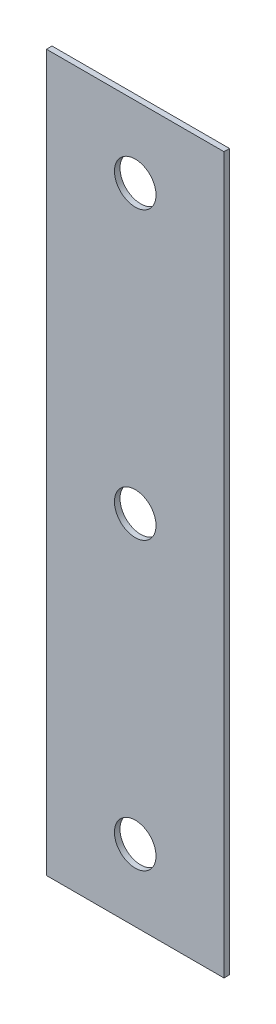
ISO-10303-21;
HEADER;
FILE_DESCRIPTION(('STEP AP214'),'2;1');
FILE_NAME('part.step','',(''),(''),'','','');
FILE_SCHEMA(('AUTOMOTIVE_DESIGN { 1 0 10303 214 1 1 1 1 }'));
ENDSEC;
DATA;
#1=APPLICATION_CONTEXT('core data for automotive mechanical design processes');
#2=APPLICATION_PROTOCOL_DEFINITION('international standard','automotive_design',2000,#1);
#3=PRODUCT_CONTEXT('',#1,'mechanical');
#4=PRODUCT('Part','Part','',(#3));
#5=PRODUCT_RELATED_PRODUCT_CATEGORY('part','',(#4));
#6=PRODUCT_DEFINITION_FORMATION('','',#4);
#7=PRODUCT_DEFINITION_CONTEXT('part definition',#1,'design');
#8=PRODUCT_DEFINITION('design','',#6,#7);
#9=PRODUCT_DEFINITION_SHAPE('','',#8);
#10=(LENGTH_UNIT() NAMED_UNIT(*) SI_UNIT(.MILLI.,.METRE.));
#11=(NAMED_UNIT(*) PLANE_ANGLE_UNIT() SI_UNIT($,.RADIAN.));
#12=(NAMED_UNIT(*) SI_UNIT($,.STERADIAN.) SOLID_ANGLE_UNIT());
#13=UNCERTAINTY_MEASURE_WITH_UNIT(LENGTH_MEASURE(1.E-05),#10,'distance_accuracy_value','');
#14=(GEOMETRIC_REPRESENTATION_CONTEXT(3) GLOBAL_UNCERTAINTY_ASSIGNED_CONTEXT((#13)) GLOBAL_UNIT_ASSIGNED_CONTEXT((#10,
#11,#12)) REPRESENTATION_CONTEXT('',''));
#15=CARTESIAN_POINT('',(0.,0.,0.));
#16=DIRECTION('',(0.,0.,1.));
#17=DIRECTION('',(1.,0.,0.));
#18=AXIS2_PLACEMENT_3D('',#15,#16,#17);
#19=CARTESIAN_POINT('',(0.,64.5,0.85));
#20=DIRECTION('',(1.,0.,0.));
#21=DIRECTION('',(0.,0.,-1.));
#22=AXIS2_PLACEMENT_3D('',#19,#20,#21);
#23=PLANE('',#22);
#24=DIRECTION('',(0.,0.,1.));
#25=VECTOR('',#24,1.);
#26=CARTESIAN_POINT('',(0.,0.,0.85));
#27=LINE('',#26,#25);
#28=CARTESIAN_POINT('',(0.,0.,0.85));
#29=VERTEX_POINT('',#28);
#30=CARTESIAN_POINT('',(0.,0.,1.35));
#31=VERTEX_POINT('',#30);
#32=EDGE_CURVE('E105',#29,#31,#27,.T.);
#33=ORIENTED_EDGE('',*,*,#32,.T.);
#34=DIRECTION('',(0.,-1.,0.));
#35=VECTOR('',#34,1.);
#36=CARTESIAN_POINT('',(0.,64.5,1.35));
#37=LINE('',#36,#35);
#38=CARTESIAN_POINT('',(0.,64.5,1.35));
#39=VERTEX_POINT('',#38);
#40=EDGE_CURVE('E12',#39,#31,#37,.T.);
#41=ORIENTED_EDGE('',*,*,#40,.F.);
#42=DIRECTION('',(0.,0.,1.));
#43=VECTOR('',#42,1.);
#44=CARTESIAN_POINT('',(0.,64.5,0.85));
#45=LINE('',#44,#43);
#46=CARTESIAN_POINT('',(0.,64.5,0.85));
#47=VERTEX_POINT('',#46);
#48=EDGE_CURVE('E91',#47,#39,#45,.T.);
#49=ORIENTED_EDGE('',*,*,#48,.F.);
#50=DIRECTION('',(0.,-1.,0.));
#51=VECTOR('',#50,1.);
#52=CARTESIAN_POINT('',(0.,64.5,0.85));
#53=LINE('',#52,#51);
#54=EDGE_CURVE('E58',#47,#29,#53,.T.);
#55=ORIENTED_EDGE('',*,*,#54,.T.);
#56=EDGE_LOOP('',(#33,#41,#49,#55));
#57=FACE_BOUND('',#56,.T.);
#58=ADVANCED_FACE('F42',(#57),#23,.F.);
#59=CARTESIAN_POINT('',(0.,64.5,1.35));
#60=DIRECTION('',(0.,0.,-1.));
#61=DIRECTION('',(-1.,0.,0.));
#62=AXIS2_PLACEMENT_3D('',#59,#60,#61);
#63=PLANE('',#62);
#64=CARTESIAN_POINT('',(8.,58.05,1.35));
#65=DIRECTION('',(0.,0.,-1.));
#66=DIRECTION('',(-1.,0.,0.));
#67=AXIS2_PLACEMENT_3D('',#64,#65,#66);
#68=CIRCLE('',#67,1.875);
#69=CARTESIAN_POINT('',(6.125,58.05,1.35));
#70=VERTEX_POINT('',#69);
#71=EDGE_CURVE('E123',#70,#70,#68,.F.);
#72=ORIENTED_EDGE('',*,*,#71,.F.);
#73=EDGE_LOOP('',(#72));
#74=FACE_BOUND('',#73,.T.);
#75=CARTESIAN_POINT('',(8.,6.45,1.35));
#76=DIRECTION('',(0.,0.,-1.));
#77=DIRECTION('',(-1.,0.,0.));
#78=AXIS2_PLACEMENT_3D('',#75,#76,#77);
#79=CIRCLE('',#78,1.875);
#80=CARTESIAN_POINT('',(6.125,6.45,1.35));
#81=VERTEX_POINT('',#80);
#82=EDGE_CURVE('E122',#81,#81,#79,.F.);
#83=ORIENTED_EDGE('',*,*,#82,.F.);
#84=EDGE_LOOP('',(#83));
#85=FACE_BOUND('',#84,.T.);
#86=CARTESIAN_POINT('',(8.,32.25,1.35));
#87=DIRECTION('',(0.,0.,-1.));
#88=DIRECTION('',(-1.,0.,0.));
#89=AXIS2_PLACEMENT_3D('',#86,#87,#88);
#90=CIRCLE('',#89,1.875);
#91=CARTESIAN_POINT('',(6.125,32.25,1.35));
#92=VERTEX_POINT('',#91);
#93=EDGE_CURVE('E107',#92,#92,#90,.F.);
#94=ORIENTED_EDGE('',*,*,#93,.F.);
#95=EDGE_LOOP('',(#94));
#96=FACE_BOUND('',#95,.T.);
#97=DIRECTION('',(1.,0.,0.));
#98=VECTOR('',#97,1.);
#99=CARTESIAN_POINT('',(0.,0.,1.35));
#100=LINE('',#99,#98);
#101=CARTESIAN_POINT('',(16.,0.,1.35));
#102=VERTEX_POINT('',#101);
#103=EDGE_CURVE('E96',#31,#102,#100,.T.);
#104=ORIENTED_EDGE('',*,*,#103,.T.);
#105=DIRECTION('',(0.,-1.,0.));
#106=VECTOR('',#105,1.);
#107=CARTESIAN_POINT('',(16.,64.5,1.35));
#108=LINE('',#107,#106);
#109=CARTESIAN_POINT('',(16.,64.5,1.35));
#110=VERTEX_POINT('',#109);
#111=EDGE_CURVE('E50',#110,#102,#108,.T.);
#112=ORIENTED_EDGE('',*,*,#111,.F.);
#113=DIRECTION('',(1.,0.,0.));
#114=VECTOR('',#113,1.);
#115=CARTESIAN_POINT('',(0.,64.5,1.35));
#116=LINE('',#115,#114);
#117=EDGE_CURVE('E83',#39,#110,#116,.T.);
#118=ORIENTED_EDGE('',*,*,#117,.F.);
#119=ORIENTED_EDGE('',*,*,#40,.T.);
#120=EDGE_LOOP('',(#104,#112,#118,#119));
#121=FACE_BOUND('',#120,.T.);
#122=ADVANCED_FACE('F95',(#74,#85,#96,#121),#63,.F.);
#123=CARTESIAN_POINT('',(16.,64.5,0.850000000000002));
#124=DIRECTION('',(1.,0.,0.));
#125=DIRECTION('',(0.,0.,-1.));
#126=AXIS2_PLACEMENT_3D('',#123,#124,#125);
#127=PLANE('',#126);
#128=DIRECTION('',(0.,0.,1.));
#129=VECTOR('',#128,1.);
#130=CARTESIAN_POINT('',(16.,0.,0.850000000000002));
#131=LINE('',#130,#129);
#132=CARTESIAN_POINT('',(16.,0.,0.850000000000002));
#133=VERTEX_POINT('',#132);
#134=EDGE_CURVE('E109',#133,#102,#131,.T.);
#135=ORIENTED_EDGE('',*,*,#134,.F.);
#136=DIRECTION('',(0.,-1.,0.));
#137=VECTOR('',#136,1.);
#138=CARTESIAN_POINT('',(16.,64.5,0.850000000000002));
#139=LINE('',#138,#137);
#140=CARTESIAN_POINT('',(16.,64.5,0.850000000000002));
#141=VERTEX_POINT('',#140);
#142=EDGE_CURVE('E72',#141,#133,#139,.T.);
#143=ORIENTED_EDGE('',*,*,#142,.F.);
#144=DIRECTION('',(0.,0.,1.));
#145=VECTOR('',#144,1.);
#146=CARTESIAN_POINT('',(16.,64.5,0.850000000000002));
#147=LINE('',#146,#145);
#148=EDGE_CURVE('E90',#141,#110,#147,.T.);
#149=ORIENTED_EDGE('',*,*,#148,.T.);
#150=ORIENTED_EDGE('',*,*,#111,.T.);
#151=EDGE_LOOP('',(#135,#143,#149,#150));
#152=FACE_BOUND('',#151,.T.);
#153=ADVANCED_FACE('F99',(#152),#127,.T.);
#154=CARTESIAN_POINT('',(0.,64.5,0.85));
#155=DIRECTION('',(0.,0.,-1.));
#156=DIRECTION('',(-1.,0.,0.));
#157=AXIS2_PLACEMENT_3D('',#154,#155,#156);
#158=PLANE('',#157);
#159=CARTESIAN_POINT('',(8.,58.05,0.850000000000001));
#160=DIRECTION('',(0.,0.,-1.));
#161=DIRECTION('',(-1.,0.,0.));
#162=AXIS2_PLACEMENT_3D('',#159,#160,#161);
#163=CIRCLE('',#162,1.875);
#164=CARTESIAN_POINT('',(6.125,58.05,0.850000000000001));
#165=VERTEX_POINT('',#164);
#166=EDGE_CURVE('E127',#165,#165,#163,.T.);
#167=ORIENTED_EDGE('',*,*,#166,.F.);
#168=EDGE_LOOP('',(#167));
#169=FACE_BOUND('',#168,.T.);
#170=CARTESIAN_POINT('',(8.,6.45,0.850000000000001));
#171=DIRECTION('',(0.,0.,-1.));
#172=DIRECTION('',(-1.,0.,0.));
#173=AXIS2_PLACEMENT_3D('',#170,#171,#172);
#174=CIRCLE('',#173,1.875);
#175=CARTESIAN_POINT('',(6.125,6.45,0.850000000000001));
#176=VERTEX_POINT('',#175);
#177=EDGE_CURVE('E126',#176,#176,#174,.T.);
#178=ORIENTED_EDGE('',*,*,#177,.F.);
#179=EDGE_LOOP('',(#178));
#180=FACE_BOUND('',#179,.T.);
#181=CARTESIAN_POINT('',(8.,32.25,0.850000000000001));
#182=DIRECTION('',(0.,0.,-1.));
#183=DIRECTION('',(-1.,0.,0.));
#184=AXIS2_PLACEMENT_3D('',#181,#182,#183);
#185=CIRCLE('',#184,1.875);
#186=CARTESIAN_POINT('',(6.125,32.25,0.850000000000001));
#187=VERTEX_POINT('',#186);
#188=EDGE_CURVE('E119',#187,#187,#185,.T.);
#189=ORIENTED_EDGE('',*,*,#188,.F.);
#190=EDGE_LOOP('',(#189));
#191=FACE_BOUND('',#190,.T.);
#192=DIRECTION('',(1.,0.,0.));
#193=VECTOR('',#192,1.);
#194=CARTESIAN_POINT('',(0.,0.,0.85));
#195=LINE('',#194,#193);
#196=EDGE_CURVE('E111',#29,#133,#195,.T.);
#197=ORIENTED_EDGE('',*,*,#196,.F.);
#198=ORIENTED_EDGE('',*,*,#54,.F.);
#199=DIRECTION('',(1.,0.,0.));
#200=VECTOR('',#199,1.);
#201=CARTESIAN_POINT('',(0.,64.5,0.85));
#202=LINE('',#201,#200);
#203=EDGE_CURVE('E100',#47,#141,#202,.T.);
#204=ORIENTED_EDGE('',*,*,#203,.T.);
#205=ORIENTED_EDGE('',*,*,#142,.T.);
#206=EDGE_LOOP('',(#197,#198,#204,#205));
#207=FACE_BOUND('',#206,.T.);
#208=ADVANCED_FACE('F138',(#169,#180,#191,#207),#158,.T.);
#209=CARTESIAN_POINT('',(0.,64.5,0.));
#210=DIRECTION('',(0.,1.,0.));
#211=DIRECTION('',(0.,0.,1.));
#212=AXIS2_PLACEMENT_3D('',#209,#210,#211);
#213=PLANE('',#212);
#214=ORIENTED_EDGE('',*,*,#48,.T.);
#215=ORIENTED_EDGE('',*,*,#117,.T.);
#216=ORIENTED_EDGE('',*,*,#148,.F.);
#217=ORIENTED_EDGE('',*,*,#203,.F.);
#218=EDGE_LOOP('',(#214,#215,#216,#217));
#219=FACE_BOUND('',#218,.T.);
#220=ADVANCED_FACE('F87',(#219),#213,.T.);
#221=CARTESIAN_POINT('',(0.,0.,0.));
#222=DIRECTION('',(0.,1.,0.));
#223=DIRECTION('',(0.,0.,1.));
#224=AXIS2_PLACEMENT_3D('',#221,#222,#223);
#225=PLANE('',#224);
#226=ORIENTED_EDGE('',*,*,#32,.F.);
#227=ORIENTED_EDGE('',*,*,#196,.T.);
#228=ORIENTED_EDGE('',*,*,#134,.T.);
#229=ORIENTED_EDGE('',*,*,#103,.F.);
#230=EDGE_LOOP('',(#226,#227,#228,#229));
#231=FACE_BOUND('',#230,.T.);
#232=ADVANCED_FACE('F148',(#231),#225,.F.);
#233=CARTESIAN_POINT('',(8.,32.25,1.351));
#234=DIRECTION('',(0.,0.,-1.));
#235=DIRECTION('',(-1.,0.,0.));
#236=AXIS2_PLACEMENT_3D('',#233,#234,#235);
#237=CYLINDRICAL_SURFACE('',#236,1.875);
#238=ORIENTED_EDGE('',*,*,#188,.T.);
#239=EDGE_LOOP('',(#238));
#240=FACE_BOUND('',#239,.T.);
#241=ORIENTED_EDGE('',*,*,#93,.T.);
#242=EDGE_LOOP('',(#241));
#243=FACE_BOUND('',#242,.T.);
#244=ADVANCED_FACE('F145',(#240,#243),#237,.F.);
#245=CARTESIAN_POINT('',(8.,6.45,1.351));
#246=DIRECTION('',(0.,0.,-1.));
#247=DIRECTION('',(-1.,0.,0.));
#248=AXIS2_PLACEMENT_3D('',#245,#246,#247);
#249=CYLINDRICAL_SURFACE('',#248,1.875);
#250=ORIENTED_EDGE('',*,*,#177,.T.);
#251=EDGE_LOOP('',(#250));
#252=FACE_BOUND('',#251,.T.);
#253=ORIENTED_EDGE('',*,*,#82,.T.);
#254=EDGE_LOOP('',(#253));
#255=FACE_BOUND('',#254,.T.);
#256=ADVANCED_FACE('F135',(#252,#255),#249,.F.);
#257=CARTESIAN_POINT('',(8.,58.05,1.351));
#258=DIRECTION('',(0.,0.,-1.));
#259=DIRECTION('',(-1.,0.,0.));
#260=AXIS2_PLACEMENT_3D('',#257,#258,#259);
#261=CYLINDRICAL_SURFACE('',#260,1.875);
#262=ORIENTED_EDGE('',*,*,#166,.T.);
#263=EDGE_LOOP('',(#262));
#264=FACE_BOUND('',#263,.T.);
#265=ORIENTED_EDGE('',*,*,#71,.T.);
#266=EDGE_LOOP('',(#265));
#267=FACE_BOUND('',#266,.T.);
#268=ADVANCED_FACE('F166',(#264,#267),#261,.F.);
#269=CLOSED_SHELL('',(#58,#122,#153,#208,#220,#232,#244,#256,#268));
#270=MANIFOLD_SOLID_BREP('B2',#269);
#271=CARTESIAN_POINT('',(-1.52270351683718,25.8421180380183,0.851));
#272=DIRECTION('',(0.,1.,0.));
#273=DIRECTION('',(0.,0.,1.));
#274=AXIS2_PLACEMENT_3D('',#271,#272,#273);
#275=PLANE('',#274);
#276=CARTESIAN_POINT('',(0.,25.8421180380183,0.));
#277=DIRECTION('',(0.,1.,0.));
#278=DIRECTION('',(0.,0.,1.));
#279=AXIS2_PLACEMENT_3D('',#276,#277,#278);
#280=CIRCLE('',#279,0.85);
#281=CARTESIAN_POINT('',(0.,25.8421180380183,0.85));
#282=VERTEX_POINT('',#281);
#283=EDGE_CURVE('E243',#282,#282,#280,.F.);
#284=ORIENTED_EDGE('',*,*,#283,.F.);
#285=EDGE_LOOP('',(#284));
#286=FACE_BOUND('',#285,.T.);
#287=ADVANCED_FACE('F236',(#286),#275,.T.);
#288=CARTESIAN_POINT('',(0.,64.5,0.));
#289=DIRECTION('',(0.,-1.,0.));
#290=DIRECTION('',(0.,0.,-1.));
#291=AXIS2_PLACEMENT_3D('',#288,#289,#290);
#292=CYLINDRICAL_SURFACE('',#291,0.85);
#293=CARTESIAN_POINT('',(0.,12.9,0.));
#294=DIRECTION('',(0.,-1.,0.));
#295=DIRECTION('',(0.,0.,-1.));
#296=AXIS2_PLACEMENT_3D('',#293,#294,#295);
#297=CIRCLE('',#296,0.85);
#298=CARTESIAN_POINT('',(0.,12.9,-0.85));
#299=VERTEX_POINT('',#298);
#300=EDGE_CURVE('E41',#299,#299,#297,.F.);
#301=ORIENTED_EDGE('',*,*,#300,.T.);
#302=EDGE_LOOP('',(#301));
#303=FACE_BOUND('',#302,.T.);
#304=ORIENTED_EDGE('',*,*,#283,.T.);
#305=EDGE_LOOP('',(#304));
#306=FACE_BOUND('',#305,.T.);
#307=ADVANCED_FACE('F238',(#303,#306),#292,.T.);
#308=CARTESIAN_POINT('',(-1.42089446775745,12.9,0.851));
#309=DIRECTION('',(0.,-1.,0.));
#310=DIRECTION('',(0.,0.,-1.));
#311=AXIS2_PLACEMENT_3D('',#308,#309,#310);
#312=PLANE('',#311);
#313=ORIENTED_EDGE('',*,*,#300,.F.);
#314=EDGE_LOOP('',(#313));
#315=FACE_BOUND('',#314,.T.);
#316=ADVANCED_FACE('F255',(#315),#312,.T.);
#317=CLOSED_SHELL('',(#287,#307,#316));
#318=MANIFOLD_SOLID_BREP('B6',#317);
#319=CARTESIAN_POINT('',(0.,64.5,0.));
#320=DIRECTION('',(0.,-1.,0.));
#321=DIRECTION('',(0.,0.,-1.));
#322=AXIS2_PLACEMENT_3D('',#319,#320,#321);
#323=CYLINDRICAL_SURFACE('',#322,0.85);
#324=CARTESIAN_POINT('',(0.,38.7421180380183,0.));
#325=DIRECTION('',(0.,-1.,0.));
#326=DIRECTION('',(0.,0.,-1.));
#327=AXIS2_PLACEMENT_3D('',#324,#325,#326);
#328=CIRCLE('',#327,0.85);
#329=CARTESIAN_POINT('',(0.,38.7421180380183,-0.85));
#330=VERTEX_POINT('',#329);
#331=EDGE_CURVE('E235',#330,#330,#328,.F.);
#332=ORIENTED_EDGE('',*,*,#331,.T.);
#333=EDGE_LOOP('',(#332));
#334=FACE_BOUND('',#333,.T.);
#335=CARTESIAN_POINT('',(0.,51.6421180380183,0.));
#336=DIRECTION('',(0.,1.,0.));
#337=DIRECTION('',(0.,0.,1.));
#338=AXIS2_PLACEMENT_3D('',#335,#336,#337);
#339=CIRCLE('',#338,0.85);
#340=CARTESIAN_POINT('',(0.,51.6421180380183,0.85));
#341=VERTEX_POINT('',#340);
#342=EDGE_CURVE('E274',#341,#341,#339,.F.);
#343=ORIENTED_EDGE('',*,*,#342,.T.);
#344=EDGE_LOOP('',(#343));
#345=FACE_BOUND('',#344,.T.);
#346=ADVANCED_FACE('F271',(#334,#345),#323,.T.);
#347=CARTESIAN_POINT('',(-1.52270351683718,51.6421180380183,0.851));
#348=DIRECTION('',(0.,1.,0.));
#349=DIRECTION('',(0.,0.,1.));
#350=AXIS2_PLACEMENT_3D('',#347,#348,#349);
#351=PLANE('',#350);
#352=ORIENTED_EDGE('',*,*,#342,.F.);
#353=EDGE_LOOP('',(#352));
#354=FACE_BOUND('',#353,.T.);
#355=ADVANCED_FACE('F284',(#354),#351,.T.);
#356=CARTESIAN_POINT('',(-1.52270351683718,38.7421180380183,0.851));
#357=DIRECTION('',(0.,-1.,0.));
#358=DIRECTION('',(0.,0.,-1.));
#359=AXIS2_PLACEMENT_3D('',#356,#357,#358);
#360=PLANE('',#359);
#361=ORIENTED_EDGE('',*,*,#331,.F.);
#362=EDGE_LOOP('',(#361));
#363=FACE_BOUND('',#362,.T.);
#364=ADVANCED_FACE('F286',(#363),#360,.T.);
#365=CLOSED_SHELL('',(#346,#355,#364));
#366=MANIFOLD_SOLID_BREP('B36',#365);
#367=ADVANCED_BREP_SHAPE_REPRESENTATION('',(#18,#270,#318,#366),#14);
#368=SHAPE_DEFINITION_REPRESENTATION(#9,#367);
ENDSEC;
END-ISO-10303-21;
